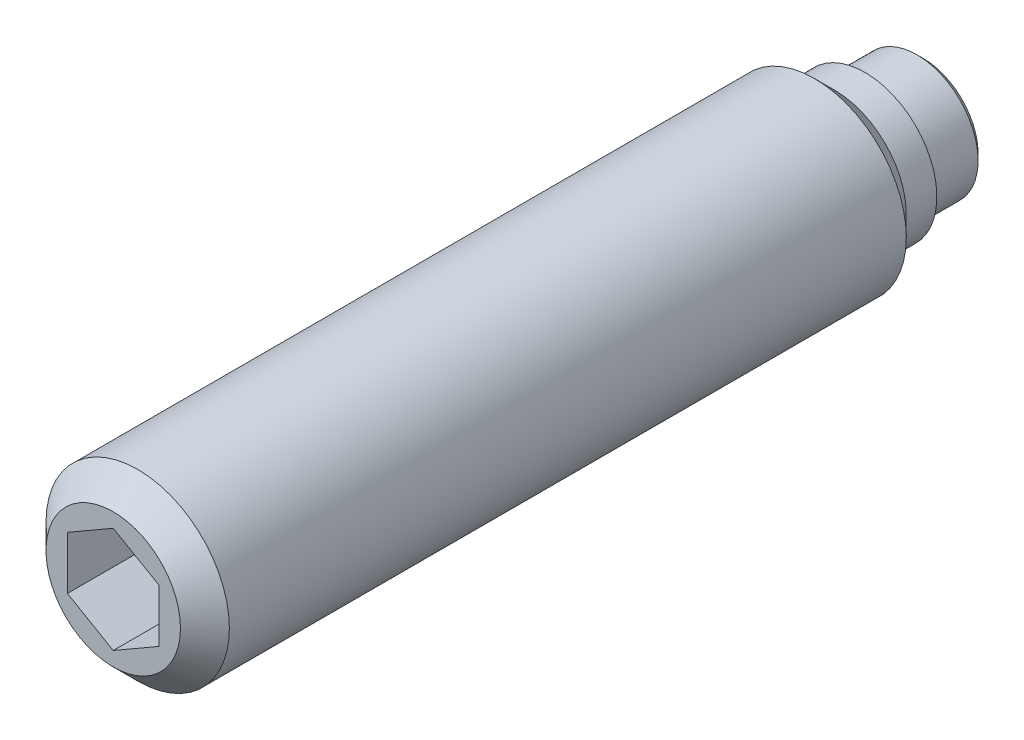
ISO-10303-21;
HEADER;
FILE_DESCRIPTION(('STEP AP214'),'2;1');
FILE_NAME('part.step','',(''),(''),'','','');
FILE_SCHEMA(('AUTOMOTIVE_DESIGN { 1 0 10303 214 1 1 1 1 }'));
ENDSEC;
DATA;
#1=APPLICATION_CONTEXT('core data for automotive mechanical design processes');
#2=APPLICATION_PROTOCOL_DEFINITION('international standard','automotive_design',2000,#1);
#3=PRODUCT_CONTEXT('',#1,'mechanical');
#4=PRODUCT('Part','Part','',(#3));
#5=PRODUCT_RELATED_PRODUCT_CATEGORY('part','',(#4));
#6=PRODUCT_DEFINITION_FORMATION('','',#4);
#7=PRODUCT_DEFINITION_CONTEXT('part definition',#1,'design');
#8=PRODUCT_DEFINITION('design','',#6,#7);
#9=PRODUCT_DEFINITION_SHAPE('','',#8);
#10=(LENGTH_UNIT() NAMED_UNIT(*) SI_UNIT(.MILLI.,.METRE.));
#11=(NAMED_UNIT(*) PLANE_ANGLE_UNIT() SI_UNIT($,.RADIAN.));
#12=(NAMED_UNIT(*) SI_UNIT($,.STERADIAN.) SOLID_ANGLE_UNIT());
#13=UNCERTAINTY_MEASURE_WITH_UNIT(LENGTH_MEASURE(1.E-05),#10,'distance_accuracy_value','');
#14=(GEOMETRIC_REPRESENTATION_CONTEXT(3) GLOBAL_UNCERTAINTY_ASSIGNED_CONTEXT((#13)) GLOBAL_UNIT_ASSIGNED_CONTEXT((#10,
#11,#12)) REPRESENTATION_CONTEXT('',''));
#15=CARTESIAN_POINT('',(0.,0.,0.));
#16=DIRECTION('',(0.,0.,1.));
#17=DIRECTION('',(1.,0.,0.));
#18=AXIS2_PLACEMENT_3D('',#15,#16,#17);
#19=CARTESIAN_POINT('',(0.,0.,1.9));
#20=DIRECTION('',(0.,0.,-1.));
#21=DIRECTION('',(-1.,0.,0.));
#22=AXIS2_PLACEMENT_3D('',#19,#20,#21);
#23=CYLINDRICAL_SURFACE('',#22,3.);
#24=CARTESIAN_POINT('',(0.,0.,3.55));
#25=DIRECTION('',(0.,0.,-1.));
#26=DIRECTION('',(-1.,0.,0.));
#27=AXIS2_PLACEMENT_3D('',#24,#25,#26);
#28=CIRCLE('',#27,3.);
#29=CARTESIAN_POINT('',(-3.,0.,3.55));
#30=VERTEX_POINT('',#29);
#31=EDGE_CURVE('E9',#30,#30,#28,.T.);
#32=ORIENTED_EDGE('',*,*,#31,.F.);
#33=EDGE_LOOP('',(#32));
#34=FACE_BOUND('',#33,.T.);
#35=CARTESIAN_POINT('',(0.,0.,25.7));
#36=DIRECTION('',(0.,0.,1.));
#37=DIRECTION('',(1.,0.,0.));
#38=AXIS2_PLACEMENT_3D('',#35,#36,#37);
#39=CIRCLE('',#38,3.);
#40=CARTESIAN_POINT('',(3.,0.,25.7));
#41=VERTEX_POINT('',#40);
#42=EDGE_CURVE('E123',#41,#41,#39,.T.);
#43=ORIENTED_EDGE('',*,*,#42,.F.);
#44=EDGE_LOOP('',(#43));
#45=FACE_BOUND('',#44,.T.);
#46=ADVANCED_FACE('F14',(#34,#45),#23,.T.);
#47=CARTESIAN_POINT('',(0.,0.,3.55));
#48=DIRECTION('',(0.,0.,1.));
#49=DIRECTION('',(1.,0.,0.));
#50=AXIS2_PLACEMENT_3D('',#47,#48,#49);
#51=CONICAL_SURFACE('',#50,3.,0.785398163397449);
#52=ORIENTED_EDGE('',*,*,#31,.T.);
#53=EDGE_LOOP('',(#52));
#54=FACE_BOUND('',#53,.T.);
#55=CARTESIAN_POINT('',(0.,0.,2.9));
#56=DIRECTION('',(0.,0.,-1.));
#57=DIRECTION('',(-1.,0.,0.));
#58=AXIS2_PLACEMENT_3D('',#55,#56,#57);
#59=CIRCLE('',#58,2.35);
#60=CARTESIAN_POINT('',(-2.35,0.,2.9));
#61=VERTEX_POINT('',#60);
#62=EDGE_CURVE('E21',#61,#61,#59,.T.);
#63=ORIENTED_EDGE('',*,*,#62,.F.);
#64=EDGE_LOOP('',(#63));
#65=FACE_BOUND('',#64,.T.);
#66=ADVANCED_FACE('F143',(#54,#65),#51,.T.);
#67=CARTESIAN_POINT('',(0.,0.,1.9));
#68=DIRECTION('',(0.,0.,-1.));
#69=DIRECTION('',(-1.,0.,0.));
#70=AXIS2_PLACEMENT_3D('',#67,#68,#69);
#71=CYLINDRICAL_SURFACE('',#70,2.35);
#72=ORIENTED_EDGE('',*,*,#62,.T.);
#73=EDGE_LOOP('',(#72));
#74=FACE_BOUND('',#73,.T.);
#75=CARTESIAN_POINT('',(0.,0.,1.9));
#76=DIRECTION('',(0.,0.,-1.));
#77=DIRECTION('',(-1.,0.,0.));
#78=AXIS2_PLACEMENT_3D('',#75,#76,#77);
#79=CIRCLE('',#78,2.35);
#80=CARTESIAN_POINT('',(-2.35,0.,1.9));
#81=VERTEX_POINT('',#80);
#82=EDGE_CURVE('E135',#81,#81,#79,.T.);
#83=ORIENTED_EDGE('',*,*,#82,.F.);
#84=EDGE_LOOP('',(#83));
#85=FACE_BOUND('',#84,.T.);
#86=ADVANCED_FACE('F140',(#74,#85),#71,.T.);
#87=CARTESIAN_POINT('',(0.,2.35,1.9));
#88=DIRECTION('',(0.,0.,1.));
#89=DIRECTION('',(1.,0.,0.));
#90=AXIS2_PLACEMENT_3D('',#87,#88,#89);
#91=PLANE('',#90);
#92=ORIENTED_EDGE('',*,*,#82,.T.);
#93=EDGE_LOOP('',(#92));
#94=FACE_BOUND('',#93,.T.);
#95=CARTESIAN_POINT('',(0.,0.,1.9));
#96=DIRECTION('',(0.,0.,-1.));
#97=DIRECTION('',(-1.,0.,0.));
#98=AXIS2_PLACEMENT_3D('',#95,#96,#97);
#99=CIRCLE('',#98,2.);
#100=CARTESIAN_POINT('',(-2.,0.,1.9));
#101=VERTEX_POINT('',#100);
#102=EDGE_CURVE('E132',#101,#101,#99,.T.);
#103=ORIENTED_EDGE('',*,*,#102,.F.);
#104=EDGE_LOOP('',(#103));
#105=FACE_BOUND('',#104,.T.);
#106=ADVANCED_FACE('F151',(#94,#105),#91,.F.);
#107=CARTESIAN_POINT('',(0.,0.,0.));
#108=DIRECTION('',(0.,0.,-1.));
#109=DIRECTION('',(-1.,0.,0.));
#110=AXIS2_PLACEMENT_3D('',#107,#108,#109);
#111=CYLINDRICAL_SURFACE('',#110,2.);
#112=CARTESIAN_POINT('',(0.,0.,0.2));
#113=DIRECTION('',(0.,0.,-1.));
#114=DIRECTION('',(-1.,0.,0.));
#115=AXIS2_PLACEMENT_3D('',#112,#113,#114);
#116=CIRCLE('',#115,2.);
#117=CARTESIAN_POINT('',(-2.,0.,0.2));
#118=VERTEX_POINT('',#117);
#119=EDGE_CURVE('E129',#118,#118,#116,.T.);
#120=ORIENTED_EDGE('',*,*,#119,.F.);
#121=EDGE_LOOP('',(#120));
#122=FACE_BOUND('',#121,.T.);
#123=ORIENTED_EDGE('',*,*,#102,.T.);
#124=EDGE_LOOP('',(#123));
#125=FACE_BOUND('',#124,.T.);
#126=ADVANCED_FACE('F157',(#122,#125),#111,.T.);
#127=CARTESIAN_POINT('',(0.,0.,0.2));
#128=DIRECTION('',(0.,0.,1.));
#129=DIRECTION('',(1.,0.,0.));
#130=AXIS2_PLACEMENT_3D('',#127,#128,#129);
#131=CONICAL_SURFACE('',#130,2.,0.785398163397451);
#132=CARTESIAN_POINT('',(0.,0.,0.));
#133=DIRECTION('',(0.,0.,-1.));
#134=DIRECTION('',(-1.,0.,0.));
#135=AXIS2_PLACEMENT_3D('',#132,#133,#134);
#136=CIRCLE('',#135,1.8);
#137=CARTESIAN_POINT('',(-1.8,0.,0.));
#138=VERTEX_POINT('',#137);
#139=EDGE_CURVE('E126',#138,#138,#136,.T.);
#140=ORIENTED_EDGE('',*,*,#139,.F.);
#141=EDGE_LOOP('',(#140));
#142=FACE_BOUND('',#141,.T.);
#143=ORIENTED_EDGE('',*,*,#119,.T.);
#144=EDGE_LOOP('',(#143));
#145=FACE_BOUND('',#144,.T.);
#146=ADVANCED_FACE('F161',(#142,#145),#131,.T.);
#147=CARTESIAN_POINT('',(0.,1.8,0.));
#148=DIRECTION('',(0.,0.,1.));
#149=DIRECTION('',(1.,0.,0.));
#150=AXIS2_PLACEMENT_3D('',#147,#148,#149);
#151=PLANE('',#150);
#152=ORIENTED_EDGE('',*,*,#139,.T.);
#153=EDGE_LOOP('',(#152));
#154=FACE_BOUND('',#153,.T.);
#155=ADVANCED_FACE('F165',(#154),#151,.F.);
#156=CARTESIAN_POINT('',(0.,0.,26.5));
#157=DIRECTION('',(0.,0.,-1.));
#158=DIRECTION('',(-1.,0.,0.));
#159=AXIS2_PLACEMENT_3D('',#156,#157,#158);
#160=CONICAL_SURFACE('',#159,2.2,0.785398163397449);
#161=ORIENTED_EDGE('',*,*,#42,.T.);
#162=EDGE_LOOP('',(#161));
#163=FACE_BOUND('',#162,.T.);
#164=CARTESIAN_POINT('',(0.,0.,26.5));
#165=DIRECTION('',(0.,0.,1.));
#166=DIRECTION('',(1.,0.,0.));
#167=AXIS2_PLACEMENT_3D('',#164,#165,#166);
#168=CIRCLE('',#167,2.2);
#169=CARTESIAN_POINT('',(2.2,0.,26.5));
#170=VERTEX_POINT('',#169);
#171=EDGE_CURVE('E115',#170,#170,#168,.T.);
#172=ORIENTED_EDGE('',*,*,#171,.F.);
#173=EDGE_LOOP('',(#172));
#174=FACE_BOUND('',#173,.T.);
#175=ADVANCED_FACE('F169',(#163,#174),#160,.T.);
#176=CARTESIAN_POINT('',(0.,0.,26.5));
#177=DIRECTION('',(0.,0.,1.));
#178=DIRECTION('',(1.,0.,0.));
#179=AXIS2_PLACEMENT_3D('',#176,#177,#178);
#180=PLANE('',#179);
#181=DIRECTION('',(0.866025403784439,-0.5,0.));
#182=VECTOR('',#181,1.);
#183=CARTESIAN_POINT('',(-1.5,-0.866025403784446,26.5));
#184=LINE('',#183,#182);
#185=CARTESIAN_POINT('',(-1.5,-0.866025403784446,26.5));
#186=VERTEX_POINT('',#185);
#187=CARTESIAN_POINT('',(0.,-1.73205080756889,26.5));
#188=VERTEX_POINT('',#187);
#189=EDGE_CURVE('E28',#186,#188,#184,.T.);
#190=ORIENTED_EDGE('',*,*,#189,.F.);
#191=DIRECTION('',(0.,-1.,0.));
#192=VECTOR('',#191,1.);
#193=CARTESIAN_POINT('',(-1.5,0.866025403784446,26.5));
#194=LINE('',#193,#192);
#195=CARTESIAN_POINT('',(-1.5,0.866025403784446,26.5));
#196=VERTEX_POINT('',#195);
#197=EDGE_CURVE('E111',#196,#186,#194,.T.);
#198=ORIENTED_EDGE('',*,*,#197,.F.);
#199=DIRECTION('',(-0.866025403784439,-0.5,0.));
#200=VECTOR('',#199,1.);
#201=CARTESIAN_POINT('',(0.,1.73205080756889,26.5));
#202=LINE('',#201,#200);
#203=CARTESIAN_POINT('',(0.,1.73205080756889,26.5));
#204=VERTEX_POINT('',#203);
#205=EDGE_CURVE('E109',#204,#196,#202,.T.);
#206=ORIENTED_EDGE('',*,*,#205,.F.);
#207=DIRECTION('',(-0.866025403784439,0.5,0.));
#208=VECTOR('',#207,1.);
#209=CARTESIAN_POINT('',(1.5,0.866025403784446,26.5));
#210=LINE('',#209,#208);
#211=CARTESIAN_POINT('',(1.5,0.866025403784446,26.5));
#212=VERTEX_POINT('',#211);
#213=EDGE_CURVE('E76',#212,#204,#210,.T.);
#214=ORIENTED_EDGE('',*,*,#213,.F.);
#215=DIRECTION('',(0.,1.,0.));
#216=VECTOR('',#215,1.);
#217=CARTESIAN_POINT('',(1.5,-0.866025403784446,26.5));
#218=LINE('',#217,#216);
#219=CARTESIAN_POINT('',(1.5,-0.866025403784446,26.5));
#220=VERTEX_POINT('',#219);
#221=EDGE_CURVE('E105',#220,#212,#218,.T.);
#222=ORIENTED_EDGE('',*,*,#221,.F.);
#223=DIRECTION('',(0.866025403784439,0.5,0.));
#224=VECTOR('',#223,1.);
#225=CARTESIAN_POINT('',(0.,-1.73205080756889,26.5));
#226=LINE('',#225,#224);
#227=EDGE_CURVE('E102',#188,#220,#226,.T.);
#228=ORIENTED_EDGE('',*,*,#227,.F.);
#229=EDGE_LOOP('',(#190,#198,#206,#214,#222,#228));
#230=FACE_BOUND('',#229,.T.);
#231=ORIENTED_EDGE('',*,*,#171,.T.);
#232=EDGE_LOOP('',(#231));
#233=FACE_BOUND('',#232,.T.);
#234=ADVANCED_FACE('F173',(#230,#233),#180,.T.);
#235=CARTESIAN_POINT('',(-1.5,-0.866025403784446,23.));
#236=DIRECTION('',(-0.5,-0.866025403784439,0.));
#237=DIRECTION('',(0.866025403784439,-0.5,0.));
#238=AXIS2_PLACEMENT_3D('',#235,#236,#237);
#239=PLANE('',#238);
#240=ORIENTED_EDGE('',*,*,#189,.T.);
#241=DIRECTION('',(0.,0.,1.));
#242=VECTOR('',#241,1.);
#243=CARTESIAN_POINT('',(0.,-1.73205080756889,23.));
#244=LINE('',#243,#242);
#245=CARTESIAN_POINT('',(0.,-1.73205080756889,23.));
#246=VERTEX_POINT('',#245);
#247=EDGE_CURVE('E58',#246,#188,#244,.T.);
#248=ORIENTED_EDGE('',*,*,#247,.F.);
#249=DIRECTION('',(0.866025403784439,-0.5,0.));
#250=VECTOR('',#249,1.);
#251=CARTESIAN_POINT('',(-1.5,-0.866025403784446,23.));
#252=LINE('',#251,#250);
#253=CARTESIAN_POINT('',(-1.5,-0.866025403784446,23.));
#254=VERTEX_POINT('',#253);
#255=EDGE_CURVE('E113',#254,#246,#252,.T.);
#256=ORIENTED_EDGE('',*,*,#255,.F.);
#257=DIRECTION('',(0.,0.,1.));
#258=VECTOR('',#257,1.);
#259=CARTESIAN_POINT('',(-1.5,-0.866025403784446,23.));
#260=LINE('',#259,#258);
#261=EDGE_CURVE('E36',#254,#186,#260,.T.);
#262=ORIENTED_EDGE('',*,*,#261,.T.);
#263=EDGE_LOOP('',(#240,#248,#256,#262));
#264=FACE_BOUND('',#263,.T.);
#265=ADVANCED_FACE('F177',(#264),#239,.F.);
#266=CARTESIAN_POINT('',(-1.5,0.866025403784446,23.));
#267=DIRECTION('',(-1.,0.,0.));
#268=DIRECTION('',(0.,0.,1.));
#269=AXIS2_PLACEMENT_3D('',#266,#267,#268);
#270=PLANE('',#269);
#271=ORIENTED_EDGE('',*,*,#197,.T.);
#272=ORIENTED_EDGE('',*,*,#261,.F.);
#273=DIRECTION('',(0.,-1.,0.));
#274=VECTOR('',#273,1.);
#275=CARTESIAN_POINT('',(-1.5,0.866025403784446,23.));
#276=LINE('',#275,#274);
#277=CARTESIAN_POINT('',(-1.5,0.866025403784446,23.));
#278=VERTEX_POINT('',#277);
#279=EDGE_CURVE('E88',#278,#254,#276,.T.);
#280=ORIENTED_EDGE('',*,*,#279,.F.);
#281=DIRECTION('',(0.,0.,1.));
#282=VECTOR('',#281,1.);
#283=CARTESIAN_POINT('',(-1.5,0.866025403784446,23.));
#284=LINE('',#283,#282);
#285=EDGE_CURVE('E80',#278,#196,#284,.T.);
#286=ORIENTED_EDGE('',*,*,#285,.T.);
#287=EDGE_LOOP('',(#271,#272,#280,#286));
#288=FACE_BOUND('',#287,.T.);
#289=ADVANCED_FACE('F181',(#288),#270,.F.);
#290=CARTESIAN_POINT('',(0.,1.73205080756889,23.));
#291=DIRECTION('',(-0.5,0.866025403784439,0.));
#292=DIRECTION('',(-0.866025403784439,-0.5,0.));
#293=AXIS2_PLACEMENT_3D('',#290,#291,#292);
#294=PLANE('',#293);
#295=ORIENTED_EDGE('',*,*,#205,.T.);
#296=ORIENTED_EDGE('',*,*,#285,.F.);
#297=DIRECTION('',(-0.866025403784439,-0.5,0.));
#298=VECTOR('',#297,1.);
#299=CARTESIAN_POINT('',(0.,1.73205080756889,23.));
#300=LINE('',#299,#298);
#301=CARTESIAN_POINT('',(0.,1.73205080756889,23.));
#302=VERTEX_POINT('',#301);
#303=EDGE_CURVE('E84',#302,#278,#300,.T.);
#304=ORIENTED_EDGE('',*,*,#303,.F.);
#305=DIRECTION('',(0.,0.,1.));
#306=VECTOR('',#305,1.);
#307=CARTESIAN_POINT('',(0.,1.73205080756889,23.));
#308=LINE('',#307,#306);
#309=EDGE_CURVE('E69',#302,#204,#308,.T.);
#310=ORIENTED_EDGE('',*,*,#309,.T.);
#311=EDGE_LOOP('',(#295,#296,#304,#310));
#312=FACE_BOUND('',#311,.T.);
#313=ADVANCED_FACE('F85',(#312),#294,.F.);
#314=CARTESIAN_POINT('',(1.5,0.866025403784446,23.));
#315=DIRECTION('',(0.5,0.866025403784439,0.));
#316=DIRECTION('',(-0.866025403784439,0.5,0.));
#317=AXIS2_PLACEMENT_3D('',#314,#315,#316);
#318=PLANE('',#317);
#319=ORIENTED_EDGE('',*,*,#213,.T.);
#320=ORIENTED_EDGE('',*,*,#309,.F.);
#321=DIRECTION('',(-0.866025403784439,0.5,0.));
#322=VECTOR('',#321,1.);
#323=CARTESIAN_POINT('',(1.5,0.866025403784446,23.));
#324=LINE('',#323,#322);
#325=CARTESIAN_POINT('',(1.5,0.866025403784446,23.));
#326=VERTEX_POINT('',#325);
#327=EDGE_CURVE('E73',#326,#302,#324,.T.);
#328=ORIENTED_EDGE('',*,*,#327,.F.);
#329=DIRECTION('',(0.,0.,1.));
#330=VECTOR('',#329,1.);
#331=CARTESIAN_POINT('',(1.5,0.866025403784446,23.));
#332=LINE('',#331,#330);
#333=EDGE_CURVE('E81',#326,#212,#332,.T.);
#334=ORIENTED_EDGE('',*,*,#333,.T.);
#335=EDGE_LOOP('',(#319,#320,#328,#334));
#336=FACE_BOUND('',#335,.T.);
#337=ADVANCED_FACE('F71',(#336),#318,.F.);
#338=CARTESIAN_POINT('',(1.5,-0.866025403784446,23.));
#339=DIRECTION('',(1.,0.,0.));
#340=DIRECTION('',(0.,0.,-1.));
#341=AXIS2_PLACEMENT_3D('',#338,#339,#340);
#342=PLANE('',#341);
#343=ORIENTED_EDGE('',*,*,#221,.T.);
#344=ORIENTED_EDGE('',*,*,#333,.F.);
#345=DIRECTION('',(0.,1.,0.));
#346=VECTOR('',#345,1.);
#347=CARTESIAN_POINT('',(1.5,-0.866025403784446,23.));
#348=LINE('',#347,#346);
#349=CARTESIAN_POINT('',(1.5,-0.866025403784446,23.));
#350=VERTEX_POINT('',#349);
#351=EDGE_CURVE('E94',#350,#326,#348,.T.);
#352=ORIENTED_EDGE('',*,*,#351,.F.);
#353=DIRECTION('',(0.,0.,1.));
#354=VECTOR('',#353,1.);
#355=CARTESIAN_POINT('',(1.5,-0.866025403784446,23.));
#356=LINE('',#355,#354);
#357=EDGE_CURVE('E118',#350,#220,#356,.T.);
#358=ORIENTED_EDGE('',*,*,#357,.T.);
#359=EDGE_LOOP('',(#343,#344,#352,#358));
#360=FACE_BOUND('',#359,.T.);
#361=ADVANCED_FACE('F185',(#360),#342,.F.);
#362=CARTESIAN_POINT('',(0.,-1.73205080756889,23.));
#363=DIRECTION('',(0.5,-0.866025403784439,0.));
#364=DIRECTION('',(0.866025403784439,0.5,0.));
#365=AXIS2_PLACEMENT_3D('',#362,#363,#364);
#366=PLANE('',#365);
#367=ORIENTED_EDGE('',*,*,#227,.T.);
#368=ORIENTED_EDGE('',*,*,#357,.F.);
#369=DIRECTION('',(0.866025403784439,0.5,0.));
#370=VECTOR('',#369,1.);
#371=CARTESIAN_POINT('',(0.,-1.73205080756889,23.));
#372=LINE('',#371,#370);
#373=EDGE_CURVE('E96',#246,#350,#372,.T.);
#374=ORIENTED_EDGE('',*,*,#373,.F.);
#375=ORIENTED_EDGE('',*,*,#247,.T.);
#376=EDGE_LOOP('',(#367,#368,#374,#375));
#377=FACE_BOUND('',#376,.T.);
#378=ADVANCED_FACE('F182',(#377),#366,.F.);
#379=CARTESIAN_POINT('',(0.,0.,23.));
#380=DIRECTION('',(0.,0.,1.));
#381=DIRECTION('',(1.,0.,0.));
#382=AXIS2_PLACEMENT_3D('',#379,#380,#381);
#383=PLANE('',#382);
#384=ORIENTED_EDGE('',*,*,#255,.T.);
#385=ORIENTED_EDGE('',*,*,#373,.T.);
#386=ORIENTED_EDGE('',*,*,#351,.T.);
#387=ORIENTED_EDGE('',*,*,#327,.T.);
#388=ORIENTED_EDGE('',*,*,#303,.T.);
#389=ORIENTED_EDGE('',*,*,#279,.T.);
#390=EDGE_LOOP('',(#384,#385,#386,#387,#388,#389));
#391=FACE_BOUND('',#390,.T.);
#392=ADVANCED_FACE('F91',(#391),#383,.T.);
#393=CLOSED_SHELL('',(#46,#66,#86,#106,#126,#146,#155,#175,#234,#265,#289,#313,#337,#361,#378,#392));
#394=MANIFOLD_SOLID_BREP('B1',#393);
#395=ADVANCED_BREP_SHAPE_REPRESENTATION('',(#18,#394),#14);
#396=SHAPE_DEFINITION_REPRESENTATION(#9,#395);
ENDSEC;
END-ISO-10303-21;
